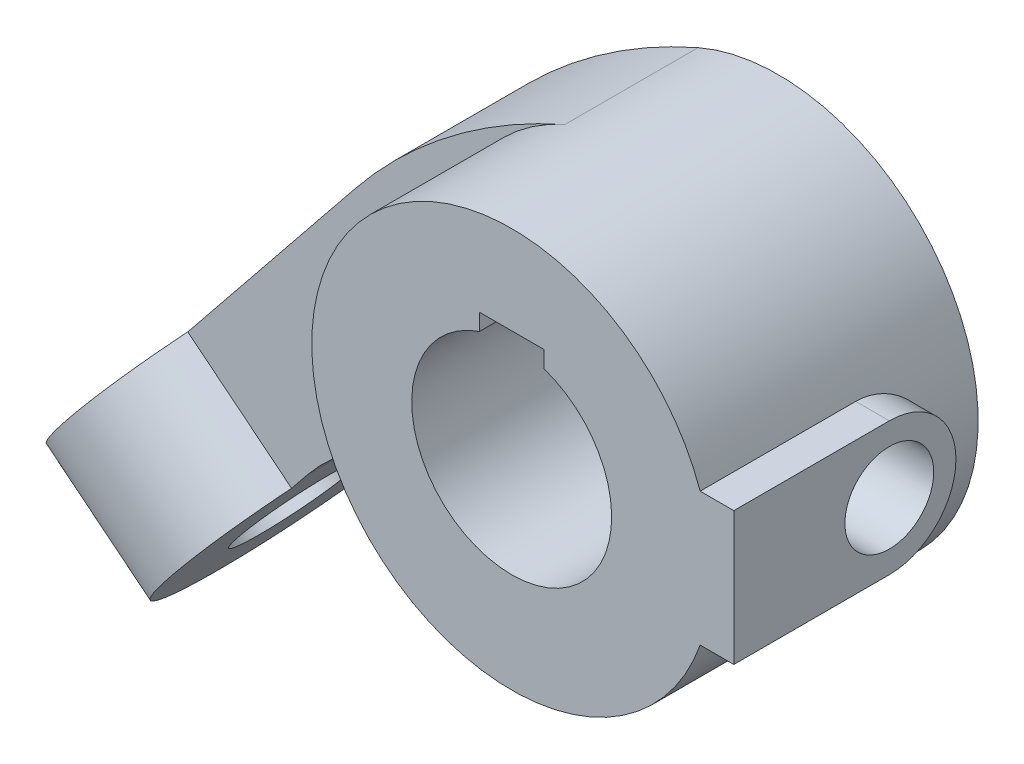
ISO-10303-21;
HEADER;
FILE_DESCRIPTION(('STEP AP214'),'2;1');
FILE_NAME('part.step','',(''),(''),'','','');
FILE_SCHEMA(('AUTOMOTIVE_DESIGN { 1 0 10303 214 1 1 1 1 }'));
ENDSEC;
DATA;
#1=APPLICATION_CONTEXT('core data for automotive mechanical design processes');
#2=APPLICATION_PROTOCOL_DEFINITION('international standard','automotive_design',2000,#1);
#3=PRODUCT_CONTEXT('',#1,'mechanical');
#4=PRODUCT('Part','Part','',(#3));
#5=PRODUCT_RELATED_PRODUCT_CATEGORY('part','',(#4));
#6=PRODUCT_DEFINITION_FORMATION('','',#4);
#7=PRODUCT_DEFINITION_CONTEXT('part definition',#1,'design');
#8=PRODUCT_DEFINITION('design','',#6,#7);
#9=PRODUCT_DEFINITION_SHAPE('','',#8);
#10=(LENGTH_UNIT() NAMED_UNIT(*) SI_UNIT(.MILLI.,.METRE.));
#11=(NAMED_UNIT(*) PLANE_ANGLE_UNIT() SI_UNIT($,.RADIAN.));
#12=(NAMED_UNIT(*) SI_UNIT($,.STERADIAN.) SOLID_ANGLE_UNIT());
#13=UNCERTAINTY_MEASURE_WITH_UNIT(LENGTH_MEASURE(1.E-05),#10,'distance_accuracy_value','');
#14=(GEOMETRIC_REPRESENTATION_CONTEXT(3) GLOBAL_UNCERTAINTY_ASSIGNED_CONTEXT((#13)) GLOBAL_UNIT_ASSIGNED_CONTEXT((#10,
#11,#12)) REPRESENTATION_CONTEXT('',''));
#15=CARTESIAN_POINT('',(0.,0.,0.));
#16=DIRECTION('',(0.,0.,1.));
#17=DIRECTION('',(1.,0.,0.));
#18=AXIS2_PLACEMENT_3D('',#15,#16,#17);
#19=CARTESIAN_POINT('',(0.,0.,24.));
#20=DIRECTION('',(0.,0.,1.));
#21=DIRECTION('',(1.,0.,0.));
#22=AXIS2_PLACEMENT_3D('',#19,#20,#21);
#23=PLANE('',#22);
#24=CARTESIAN_POINT('',(0.,0.,24.));
#25=DIRECTION('',(0.,0.,1.));
#26=DIRECTION('',(1.,0.,0.));
#27=AXIS2_PLACEMENT_3D('',#24,#25,#26);
#28=CIRCLE('',#27,18.);
#29=CARTESIAN_POINT('',(16.9705627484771,6.,24.));
#30=VERTEX_POINT('',#29);
#31=CARTESIAN_POINT('',(16.9705627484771,-6.,24.));
#32=VERTEX_POINT('',#31);
#33=EDGE_CURVE('E54',#30,#32,#28,.T.);
#34=ORIENTED_EDGE('',*,*,#33,.T.);
#35=DIRECTION('',(1.,0.,0.));
#36=VECTOR('',#35,1.);
#37=CARTESIAN_POINT('',(-500000.,-6.,24.));
#38=LINE('',#37,#36);
#39=CARTESIAN_POINT('',(20.,-6.,24.));
#40=VERTEX_POINT('',#39);
#41=EDGE_CURVE('E61',#32,#40,#38,.T.);
#42=ORIENTED_EDGE('',*,*,#41,.T.);
#43=DIRECTION('',(0.,-1.,0.));
#44=VECTOR('',#43,1.);
#45=CARTESIAN_POINT('',(20.,6.,24.));
#46=LINE('',#45,#44);
#47=CARTESIAN_POINT('',(20.,6.,24.));
#48=VERTEX_POINT('',#47);
#49=EDGE_CURVE('E164',#48,#40,#46,.T.);
#50=ORIENTED_EDGE('',*,*,#49,.F.);
#51=DIRECTION('',(1.,0.,0.));
#52=VECTOR('',#51,1.);
#53=CARTESIAN_POINT('',(-500000.,6.,24.));
#54=LINE('',#53,#52);
#55=EDGE_CURVE('E151',#30,#48,#54,.T.);
#56=ORIENTED_EDGE('',*,*,#55,.F.);
#57=EDGE_LOOP('',(#34,#42,#50,#56));
#58=FACE_BOUND('',#57,.T.);
#59=DIRECTION('',(0.,1.,0.));
#60=VECTOR('',#59,1.);
#61=CARTESIAN_POINT('',(2.90072703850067,10.0197290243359,24.));
#62=LINE('',#61,#60);
#63=CARTESIAN_POINT('',(2.90072703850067,8.51972902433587,24.));
#64=VERTEX_POINT('',#63);
#65=CARTESIAN_POINT('',(2.90072703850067,10.0197290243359,24.));
#66=VERTEX_POINT('',#65);
#67=EDGE_CURVE('E200',#64,#66,#62,.T.);
#68=ORIENTED_EDGE('',*,*,#67,.F.);
#69=CARTESIAN_POINT('',(0.,0.,24.));
#70=DIRECTION('',(0.,0.,1.));
#71=DIRECTION('',(1.,0.,0.));
#72=AXIS2_PLACEMENT_3D('',#69,#70,#71);
#73=CIRCLE('',#72,9.);
#74=CARTESIAN_POINT('',(-2.90072703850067,8.51972902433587,24.));
#75=VERTEX_POINT('',#74);
#76=EDGE_CURVE('E185',#75,#64,#73,.T.);
#77=ORIENTED_EDGE('',*,*,#76,.F.);
#78=DIRECTION('',(0.,-1.,0.));
#79=VECTOR('',#78,1.);
#80=CARTESIAN_POINT('',(-2.90072703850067,8.51972902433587,24.));
#81=LINE('',#80,#79);
#82=CARTESIAN_POINT('',(-2.90072703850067,10.0197290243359,24.));
#83=VERTEX_POINT('',#82);
#84=EDGE_CURVE('E181',#83,#75,#81,.T.);
#85=ORIENTED_EDGE('',*,*,#84,.F.);
#86=DIRECTION('',(-1.,0.,0.));
#87=VECTOR('',#86,1.);
#88=CARTESIAN_POINT('',(-2.90072703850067,10.0197290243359,24.));
#89=LINE('',#88,#87);
#90=EDGE_CURVE('E197',#66,#83,#89,.T.);
#91=ORIENTED_EDGE('',*,*,#90,.F.);
#92=EDGE_LOOP('',(#68,#77,#85,#91));
#93=FACE_BOUND('',#92,.T.);
#94=ADVANCED_FACE('F45',(#58,#93),#23,.T.);
#95=CARTESIAN_POINT('',(0.,0.,0.));
#96=DIRECTION('',(0.,0.,1.));
#97=DIRECTION('',(1.,0.,0.));
#98=AXIS2_PLACEMENT_3D('',#95,#96,#97);
#99=PLANE('',#98);
#100=DIRECTION('',(-0.627253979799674,-0.778814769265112,0.));
#101=VECTOR('',#100,1.);
#102=CARTESIAN_POINT('',(-37.7431371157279,-31.5320829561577,0.));
#103=LINE('',#102,#101);
#104=CARTESIAN_POINT('',(-30.4178085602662,-22.4367655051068,0.));
#105=VERTEX_POINT('',#104);
#106=CARTESIAN_POINT('',(-31.8145022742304,-24.1709365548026,0.));
#107=VERTEX_POINT('',#106);
#108=EDGE_CURVE('E212',#105,#107,#103,.T.);
#109=ORIENTED_EDGE('',*,*,#108,.T.);
#110=DIRECTION('',(0.778814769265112,-0.627253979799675,0.));
#111=VECTOR('',#110,1.);
#112=CARTESIAN_POINT('',(-41.1602795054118,-16.6438887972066,0.));
#113=LINE('',#112,#111);
#114=CARTESIAN_POINT('',(-41.1602795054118,-16.6438887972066,0.));
#115=VERTEX_POINT('',#114);
#116=EDGE_CURVE('E224',#107,#115,#113,.F.);
#117=ORIENTED_EDGE('',*,*,#116,.T.);
#118=DIRECTION('',(0.627253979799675,0.778814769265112,0.));
#119=VECTOR('',#118,1.);
#120=CARTESIAN_POINT('',(-41.4315114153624,-16.9806573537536,0.));
#121=LINE('',#120,#119);
#122=CARTESIAN_POINT('',(-26.1041262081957,2.05022066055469,0.));
#123=VERTEX_POINT('',#122);
#124=EDGE_CURVE('E222',#115,#123,#121,.T.);
#125=ORIENTED_EDGE('',*,*,#124,.T.);
#126=CARTESIAN_POINT('',(12.8366122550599,-29.312478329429,0.));
#127=DIRECTION('',(0.,0.,-1.));
#128=DIRECTION('',(-1.,0.,0.));
#129=AXIS2_PLACEMENT_3D('',#126,#127,#128);
#130=CIRCLE('',#129,50.);
#131=CARTESIAN_POINT('',(-7.22059439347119,16.4882690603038,0.));
#132=VERTEX_POINT('',#131);
#133=EDGE_CURVE('E219',#123,#132,#130,.T.);
#134=ORIENTED_EDGE('',*,*,#133,.T.);
#135=CARTESIAN_POINT('',(0.,0.,0.));
#136=DIRECTION('',(0.,0.,1.));
#137=DIRECTION('',(1.,0.,0.));
#138=AXIS2_PLACEMENT_3D('',#135,#136,#137);
#139=CIRCLE('',#138,18.);
#140=CARTESIAN_POINT('',(-7.0301904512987,-16.5703476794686,0.));
#141=VERTEX_POINT('',#140);
#142=EDGE_CURVE('E167',#141,#132,#139,.T.);
#143=ORIENTED_EDGE('',*,*,#142,.F.);
#144=CARTESIAN_POINT('',(-14.8415131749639,-34.9818451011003,0.));
#145=DIRECTION('',(0.,0.,1.));
#146=DIRECTION('',(-1.,0.,0.));
#147=AXIS2_PLACEMENT_3D('',#144,#145,#146);
#148=CIRCLE('',#147,20.);
#149=EDGE_CURVE('E216',#141,#105,#148,.T.);
#150=ORIENTED_EDGE('',*,*,#149,.T.);
#151=EDGE_LOOP('',(#109,#117,#125,#134,#143,#150));
#152=FACE_BOUND('',#151,.T.);
#153=CARTESIAN_POINT('',(0.,0.,0.));
#154=DIRECTION('',(0.,0.,1.));
#155=DIRECTION('',(1.,0.,0.));
#156=AXIS2_PLACEMENT_3D('',#153,#154,#155);
#157=CIRCLE('',#156,9.);
#158=CARTESIAN_POINT('',(-2.90072703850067,8.51972902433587,0.));
#159=VERTEX_POINT('',#158);
#160=CARTESIAN_POINT('',(2.90072703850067,8.51972902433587,0.));
#161=VERTEX_POINT('',#160);
#162=EDGE_CURVE('E192',#159,#161,#157,.T.);
#163=ORIENTED_EDGE('',*,*,#162,.T.);
#164=DIRECTION('',(0.,1.,0.));
#165=VECTOR('',#164,1.);
#166=CARTESIAN_POINT('',(2.90072703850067,10.0197290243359,0.));
#167=LINE('',#166,#165);
#168=CARTESIAN_POINT('',(2.90072703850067,10.0197290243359,0.));
#169=VERTEX_POINT('',#168);
#170=EDGE_CURVE('E189',#161,#169,#167,.T.);
#171=ORIENTED_EDGE('',*,*,#170,.T.);
#172=DIRECTION('',(-1.,0.,0.));
#173=VECTOR('',#172,1.);
#174=CARTESIAN_POINT('',(-2.90072703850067,10.0197290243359,0.));
#175=LINE('',#174,#173);
#176=CARTESIAN_POINT('',(-2.90072703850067,10.0197290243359,0.));
#177=VERTEX_POINT('',#176);
#178=EDGE_CURVE('E186',#169,#177,#175,.T.);
#179=ORIENTED_EDGE('',*,*,#178,.T.);
#180=DIRECTION('',(0.,-1.,0.));
#181=VECTOR('',#180,1.);
#182=CARTESIAN_POINT('',(-2.90072703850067,8.51972902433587,0.));
#183=LINE('',#182,#181);
#184=EDGE_CURVE('E182',#177,#159,#183,.T.);
#185=ORIENTED_EDGE('',*,*,#184,.T.);
#186=EDGE_LOOP('',(#163,#171,#179,#185));
#187=FACE_BOUND('',#186,.T.);
#188=ADVANCED_FACE('F290',(#152,#187),#99,.F.);
#189=CARTESIAN_POINT('',(0.,0.,24.));
#190=DIRECTION('',(0.,0.,-1.));
#191=DIRECTION('',(-1.,0.,0.));
#192=AXIS2_PLACEMENT_3D('',#189,#190,#191);
#193=CYLINDRICAL_SURFACE('',#192,18.);
#194=CARTESIAN_POINT('',(0.,0.,12.));
#195=DIRECTION('',(0.,0.,1.));
#196=DIRECTION('',(-1.,0.,0.));
#197=AXIS2_PLACEMENT_3D('',#194,#195,#196);
#198=CIRCLE('',#197,18.);
#199=CARTESIAN_POINT('',(-7.22059439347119,16.4882690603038,12.));
#200=VERTEX_POINT('',#199);
#201=CARTESIAN_POINT('',(-7.0301904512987,-16.5703476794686,12.));
#202=VERTEX_POINT('',#201);
#203=EDGE_CURVE('E230',#200,#202,#198,.T.);
#204=ORIENTED_EDGE('',*,*,#203,.T.);
#205=DIRECTION('',(0.,0.,-1.));
#206=VECTOR('',#205,1.);
#207=CARTESIAN_POINT('',(-7.0301904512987,-16.5703476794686,12.));
#208=LINE('',#207,#206);
#209=EDGE_CURVE('E208',#202,#141,#208,.T.);
#210=ORIENTED_EDGE('',*,*,#209,.T.);
#211=ORIENTED_EDGE('',*,*,#142,.T.);
#212=DIRECTION('',(0.,0.,-1.));
#213=VECTOR('',#212,1.);
#214=CARTESIAN_POINT('',(-7.22059439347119,16.4882690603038,12.));
#215=LINE('',#214,#213);
#216=EDGE_CURVE('E69',#200,#132,#215,.T.);
#217=ORIENTED_EDGE('',*,*,#216,.F.);
#218=EDGE_LOOP('',(#204,#210,#211,#217));
#219=FACE_BOUND('',#218,.T.);
#220=ORIENTED_EDGE('',*,*,#33,.F.);
#221=DIRECTION('',(0.,0.,-1.));
#222=VECTOR('',#221,1.);
#223=CARTESIAN_POINT('',(16.9705627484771,6.,24.));
#224=LINE('',#223,#222);
#225=CARTESIAN_POINT('',(16.9705627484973,6.,10.));
#226=VERTEX_POINT('',#225);
#227=EDGE_CURVE('E147',#226,#30,#224,.F.);
#228=ORIENTED_EDGE('',*,*,#227,.F.);
#229=CARTESIAN_POINT('',(16.9705627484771,-6.,10.));
#230=CARTESIAN_POINT('',(16.9705358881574,-6.00002327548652,9.83630598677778));
#231=CARTESIAN_POINT('',(16.9729302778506,-5.99330214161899,9.6726221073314));
#232=CARTESIAN_POINT('',(16.9823649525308,-5.96654425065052,9.34652402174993));
#233=CARTESIAN_POINT('',(16.9894039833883,-5.94651108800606,9.18410948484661));
#234=CARTESIAN_POINT('',(17.0079041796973,-5.89338071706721,8.86218579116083));
#235=CARTESIAN_POINT('',(17.0193522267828,-5.86032225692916,8.70266947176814));
#236=CARTESIAN_POINT('',(17.0463054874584,-5.78145443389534,8.38716979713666));
#237=CARTESIAN_POINT('',(17.0618108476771,-5.73564461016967,8.23118656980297));
#238=CARTESIAN_POINT('',(17.096396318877,-5.63171582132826,7.92393152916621));
#239=CARTESIAN_POINT('',(17.1154735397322,-5.57360680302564,7.77265602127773));
#240=CARTESIAN_POINT('',(17.1566605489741,-5.44550500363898,7.47558904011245));
#241=CARTESIAN_POINT('',(17.1787714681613,-5.37550778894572,7.32979963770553));
#242=CARTESIAN_POINT('',(17.2254031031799,-5.22415126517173,7.04461346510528));
#243=CARTESIAN_POINT('',(17.2499242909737,-5.14278972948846,6.90521795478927));
#244=CARTESIAN_POINT('',(17.3007173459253,-4.96924085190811,6.63360277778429));
#245=CARTESIAN_POINT('',(17.326989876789,-4.8770493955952,6.50138586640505));
#246=CARTESIAN_POINT('',(17.3815260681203,-4.67904463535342,6.24043953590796));
#247=CARTESIAN_POINT('',(17.4098272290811,-4.57286774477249,6.11199371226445));
#248=CARTESIAN_POINT('',(17.4667935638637,-4.35021031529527,5.86437382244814));
#249=CARTESIAN_POINT('',(17.49545886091,-4.23372620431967,5.74520299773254));
#250=CARTESIAN_POINT('',(17.5523750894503,-3.99119540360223,5.51691026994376));
#251=CARTESIAN_POINT('',(17.5806260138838,-3.86514855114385,5.40778853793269));
#252=CARTESIAN_POINT('',(17.6359611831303,-3.60425478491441,5.20029931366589));
#253=CARTESIAN_POINT('',(17.6630454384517,-3.46940795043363,5.1019317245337));
#254=CARTESIAN_POINT('',(17.716017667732,-3.18806208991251,4.91417565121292));
#255=CARTESIAN_POINT('',(17.7418552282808,-3.04134950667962,4.82509253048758));
#256=CARTESIAN_POINT('',(17.790803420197,-2.74053335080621,4.65968846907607));
#257=CARTESIAN_POINT('',(17.8139150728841,-2.5864325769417,4.58336274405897));
#258=CARTESIAN_POINT('',(17.8567641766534,-2.27182245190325,4.44406426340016));
#259=CARTESIAN_POINT('',(17.8765010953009,-2.1113120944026,4.38109361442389));
#260=CARTESIAN_POINT('',(17.9120119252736,-1.78513959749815,4.26911941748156));
#261=CARTESIAN_POINT('',(17.9277876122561,-1.61947980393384,4.22010961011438));
#262=CARTESIAN_POINT('',(17.9544516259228,-1.28997729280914,4.13793631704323));
#263=CARTESIAN_POINT('',(17.9654893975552,-1.12626807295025,4.10428575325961));
#264=CARTESIAN_POINT('',(17.9831292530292,-0.796442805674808,4.05074979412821));
#265=CARTESIAN_POINT('',(17.9897331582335,-0.630327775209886,4.03085874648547));
#266=CARTESIAN_POINT('',(17.9983239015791,-0.296898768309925,4.00501776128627));
#267=CARTESIAN_POINT('',(18.0003107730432,-0.129584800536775,3.99906772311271));
#268=CARTESIAN_POINT('',(17.999610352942,0.204943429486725,4.00116890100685));
#269=CARTESIAN_POINT('',(17.9969231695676,0.372157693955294,4.00921979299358));
#270=CARTESIAN_POINT('',(17.987149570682,0.698613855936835,4.03864685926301));
#271=CARTESIAN_POINT('',(17.9802409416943,0.857909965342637,4.05948465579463));
#272=CARTESIAN_POINT('',(17.9623622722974,1.17415159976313,4.1138198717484));
#273=CARTESIAN_POINT('',(17.9513908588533,1.33109631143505,4.14732157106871));
#274=CARTESIAN_POINT('',(17.9256761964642,1.64145470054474,4.22667565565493));
#275=CARTESIAN_POINT('',(17.9109342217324,1.79486955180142,4.27252386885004));
#276=CARTESIAN_POINT('',(17.8780472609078,2.09727695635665,4.37621207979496));
#277=CARTESIAN_POINT('',(17.8599009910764,2.24626781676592,4.4340566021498));
#278=CARTESIAN_POINT('',(17.8204139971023,2.54070679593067,4.56208597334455));
#279=CARTESIAN_POINT('',(17.7990354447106,2.686085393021,4.632418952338));
#280=CARTESIAN_POINT('',(17.753792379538,2.97045362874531,4.78440731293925));
#281=CARTESIAN_POINT('',(17.7299270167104,3.10944105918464,4.86606656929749));
#282=CARTESIAN_POINT('',(17.6803107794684,3.38017058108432,5.04012638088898));
#283=CARTESIAN_POINT('',(17.6545598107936,3.51191230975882,5.13252747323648));
#284=CARTESIAN_POINT('',(17.601809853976,3.76740071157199,5.32747242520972));
#285=CARTESIAN_POINT('',(17.5748108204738,3.89114709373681,5.43001665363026));
#286=CARTESIAN_POINT('',(17.5189422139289,4.13559143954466,5.64969602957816));
#287=CARTESIAN_POINT('',(17.4900445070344,4.2558696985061,5.76729146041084));
#288=CARTESIAN_POINT('',(17.4324086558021,4.48611320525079,6.01214074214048));
#289=CARTESIAN_POINT('',(17.4036704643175,4.59608167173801,6.13939155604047));
#290=CARTESIAN_POINT('',(17.3471202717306,4.8051173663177,6.40289722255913));
#291=CARTESIAN_POINT('',(17.3193089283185,4.90417696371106,6.53915827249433));
#292=CARTESIAN_POINT('',(17.2654357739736,5.09059336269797,6.81971485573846));
#293=CARTESIAN_POINT('',(17.239373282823,5.17795472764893,6.96400722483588));
#294=CARTESIAN_POINT('',(17.1893738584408,5.34161618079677,7.2620310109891));
#295=CARTESIAN_POINT('',(17.1654753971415,5.41772728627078,7.41587280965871));
#296=CARTESIAN_POINT('',(17.1210224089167,5.556609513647,7.72985774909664));
#297=CARTESIAN_POINT('',(17.1004664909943,5.61938618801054,7.8899982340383));
#298=CARTESIAN_POINT('',(17.0633817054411,5.73100924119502,8.21532287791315));
#299=CARTESIAN_POINT('',(17.0468484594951,5.7798707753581,8.38050133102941));
#300=CARTESIAN_POINT('',(17.0183470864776,5.86325820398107,8.71475296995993));
#301=CARTESIAN_POINT('',(17.0063768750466,5.89779064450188,8.88382434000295));
#302=CARTESIAN_POINT('',(16.9882040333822,5.94992929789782,9.21046348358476));
#303=CARTESIAN_POINT('',(16.9816058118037,5.96870055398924,9.36782418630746));
#304=CARTESIAN_POINT('',(16.9727764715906,5.99373749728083,9.6834525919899));
#305=CARTESIAN_POINT('',(16.9705397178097,6.00001932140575,9.84171885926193));
#306=CARTESIAN_POINT('',(16.9705627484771,6.,10.));
#307=B_SPLINE_CURVE_WITH_KNOTS('',3,(#229,#230,#231,#232,#233,#234,#235,#236,#237,#238,#239,
#240,#241,#242,#243,#244,#245,#246,#247,#248,#249,#250,#251,#252,#253,#254,#255,#256,#257,#258,
#259,#260,#261,#262,#263,#264,#265,#266,#267,#268,#269,#270,#271,#272,#273,#274,#275,#276,#277,
#278,#279,#280,#281,#282,#283,#284,#285,#286,#287,#288,#289,#290,#291,#292,#293,#294,#295,#296,
#297,#298,#299,#300,#301,#302,#303,#304,#305,#306),.UNSPECIFIED.,.F.,.F.,(4,2,2,2,2,2,2,2,2,2,2,
2,2,2,2,2,2,2,2,2,2,2,2,2,2,2,2,2,2,2,2,2,2,2,2,2,2,2,4),(0.,0.49091090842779,0.981689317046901,
1.47101863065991,1.96036563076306,2.4493183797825,2.93845388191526,3.427685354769,
3.91710329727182,4.42363425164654,4.93034144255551,5.43705725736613,5.94376850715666,
6.46384823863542,6.98373248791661,7.50369868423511,8.02343138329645,8.52528690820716,
9.0269361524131,9.52858177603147,10.0302157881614,10.5120543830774,10.9940559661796,
11.4758948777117,11.9579158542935,12.4460912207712,12.9344340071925,13.4228012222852,
13.9111862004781,14.4226273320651,14.9339082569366,15.445544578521,15.9569807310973,
16.4762155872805,16.9952338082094,17.5136845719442,18.0318982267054,18.5071898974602,
18.9818670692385),.UNSPECIFIED.);
#308=CARTESIAN_POINT('',(16.9705627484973,-6.,10.));
#309=VERTEX_POINT('',#308);
#310=EDGE_CURVE('E158',#309,#226,#307,.T.);
#311=ORIENTED_EDGE('',*,*,#310,.F.);
#312=DIRECTION('',(0.,0.,-1.));
#313=VECTOR('',#312,1.);
#314=CARTESIAN_POINT('',(16.9705627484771,-6.,24.));
#315=LINE('',#314,#313);
#316=EDGE_CURVE('E157',#32,#309,#315,.T.);
#317=ORIENTED_EDGE('',*,*,#316,.F.);
#318=EDGE_LOOP('',(#220,#228,#311,#317));
#319=FACE_BOUND('',#318,.T.);
#320=ADVANCED_FACE('F47',(#219,#319),#193,.T.);
#321=CARTESIAN_POINT('',(0.,0.,24.));
#322=DIRECTION('',(0.,0.,-1.));
#323=DIRECTION('',(-1.,0.,0.));
#324=AXIS2_PLACEMENT_3D('',#321,#322,#323);
#325=CYLINDRICAL_SURFACE('',#324,9.);
#326=CARTESIAN_POINT('',(9.,0.,6.));
#327=CARTESIAN_POINT('',(8.99999931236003,0.106543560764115,6.00000083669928));
#328=CARTESIAN_POINT('',(8.99810295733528,0.21311453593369,6.00426262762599));
#329=CARTESIAN_POINT('',(8.99056534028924,0.425487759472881,6.02126641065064));
#330=CARTESIAN_POINT('',(8.9849219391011,0.531289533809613,6.03401324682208));
#331=CARTESIAN_POINT('',(8.97002203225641,0.741497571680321,6.06788489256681));
#332=CARTESIAN_POINT('',(8.96075877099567,0.845900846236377,6.08902536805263));
#333=CARTESIAN_POINT('',(8.93886560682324,1.0523739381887,6.13945271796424));
#334=CARTESIAN_POINT('',(8.92623432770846,1.15444278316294,6.16874292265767));
#335=CARTESIAN_POINT('',(8.88385509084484,1.45528706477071,6.26817316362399));
#336=CARTESIAN_POINT('',(8.84954694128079,1.64969223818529,6.35003546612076));
#337=CARTESIAN_POINT('',(8.77205693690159,2.02169397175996,6.54215732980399));
#338=CARTESIAN_POINT('',(8.72887710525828,2.19929435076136,6.65241041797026));
#339=CARTESIAN_POINT('',(8.63520005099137,2.54295194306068,6.90467040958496));
#340=CARTESIAN_POINT('',(8.58444255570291,2.70796463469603,7.048005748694));
#341=CARTESIAN_POINT('',(8.48237167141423,3.01251193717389,7.35948605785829));
#342=CARTESIAN_POINT('',(8.43105797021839,3.15203136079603,7.52764570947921));
#343=CARTESIAN_POINT('',(8.33031613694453,3.40970641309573,7.89592097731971));
#344=CARTESIAN_POINT('',(8.28116793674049,3.52616342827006,8.09732107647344));
#345=CARTESIAN_POINT('',(8.21620901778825,3.67379855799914,8.41355835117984));
#346=CARTESIAN_POINT('',(8.19601074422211,3.71851343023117,8.52136957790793));
#347=CARTESIAN_POINT('',(8.15924882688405,3.79849956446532,8.74101911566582));
#348=CARTESIAN_POINT('',(8.14268322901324,3.83377590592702,8.85285522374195));
#349=CARTESIAN_POINT('',(8.11458487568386,3.89288163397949,9.0737900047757));
#350=CARTESIAN_POINT('',(8.1028347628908,3.91721191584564,9.18272742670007));
#351=CARTESIAN_POINT('',(8.08362129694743,3.95670961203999,9.40257833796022));
#352=CARTESIAN_POINT('',(8.07615587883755,3.9718814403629,9.51349084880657));
#353=CARTESIAN_POINT('',(8.06579894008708,3.99287182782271,9.73637224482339));
#354=CARTESIAN_POINT('',(8.06290582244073,3.99869365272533,9.84834074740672));
#355=CARTESIAN_POINT('',(8.06180452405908,4.00091360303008,10.0723891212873));
#356=CARTESIAN_POINT('',(8.06359604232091,3.99731233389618,10.1844689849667));
#357=CARTESIAN_POINT('',(8.07142338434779,3.98148137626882,10.3977271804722));
#358=CARTESIAN_POINT('',(8.07706352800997,3.97005575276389,10.4989804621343));
#359=CARTESIAN_POINT('',(8.09197245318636,3.9395760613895,10.7000710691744));
#360=CARTESIAN_POINT('',(8.10124240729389,3.92051952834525,10.7999079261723));
#361=CARTESIAN_POINT('',(8.13408651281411,3.85217674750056,11.0962376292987));
#362=CARTESIAN_POINT('',(8.16270181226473,3.79170447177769,11.2897178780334));
#363=CARTESIAN_POINT('',(8.23081734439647,3.64150006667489,11.6678984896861));
#364=CARTESIAN_POINT('',(8.2705474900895,3.5511416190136,11.8523042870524));
#365=CARTESIAN_POINT('',(8.35638151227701,3.34416344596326,12.2041434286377));
#366=CARTESIAN_POINT('',(8.40248806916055,3.22753266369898,12.3715695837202));
#367=CARTESIAN_POINT('',(8.50133279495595,2.95801583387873,12.701829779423));
#368=CARTESIAN_POINT('',(8.55427944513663,2.80270476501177,12.8626276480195));
#369=CARTESIAN_POINT('',(8.65709798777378,2.46687651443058,13.1566341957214));
#370=CARTESIAN_POINT('',(8.70696894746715,2.28635173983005,13.2898345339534));
#371=CARTESIAN_POINT('',(8.79984898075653,1.89830549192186,13.5284266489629));
#372=CARTESIAN_POINT('',(8.84261183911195,1.69014406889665,13.6328807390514));
#373=CARTESIAN_POINT('',(8.91451161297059,1.25681485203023,13.8045538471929));
#374=CARTESIAN_POINT('',(8.94365711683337,1.03165788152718,13.8717963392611));
#375=CARTESIAN_POINT('',(8.98336516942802,0.587641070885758,13.9626237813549));
#376=CARTESIAN_POINT('',(8.99508492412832,0.369442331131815,13.9889334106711));
#377=CARTESIAN_POINT('',(9.00240007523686,-0.0685540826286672,14.005406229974));
#378=CARTESIAN_POINT('',(8.9980009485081,-0.288351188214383,13.9955816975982));
#379=CARTESIAN_POINT('',(8.97430591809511,-0.70981481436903,13.9419129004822));
#380=CARTESIAN_POINT('',(8.95589038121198,-0.911792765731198,13.9000783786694));
#381=CARTESIAN_POINT('',(8.90701082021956,-1.30558421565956,13.7864838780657));
#382=CARTESIAN_POINT('',(8.87654533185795,-1.49739647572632,13.7147202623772));
#383=CARTESIAN_POINT('',(8.80524764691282,-1.87220783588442,13.5410228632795));
#384=CARTESIAN_POINT('',(8.76412168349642,-2.05474529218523,13.4382176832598));
#385=CARTESIAN_POINT('',(8.67576208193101,-2.40063957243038,13.2062947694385));
#386=CARTESIAN_POINT('',(8.62852578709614,-2.56398799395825,13.0771655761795));
#387=CARTESIAN_POINT('',(8.52825739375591,-2.88073032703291,12.7841760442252));
#388=CARTESIAN_POINT('',(8.4750650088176,-3.03226090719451,12.6183553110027));
#389=CARTESIAN_POINT('',(8.37207677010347,-3.30602071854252,12.2628521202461));
#390=CARTESIAN_POINT('',(8.32228212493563,-3.42823956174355,12.0731612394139));
#391=CARTESIAN_POINT('',(8.25404075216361,-3.5880743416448,11.771754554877));
#392=CARTESIAN_POINT('',(8.23214803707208,-3.63788387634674,11.6671202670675));
#393=CARTESIAN_POINT('',(8.19154569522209,-3.72840991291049,11.4534110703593));
#394=CARTESIAN_POINT('',(8.17283464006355,-3.76913049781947,11.3443381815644));
#395=CARTESIAN_POINT('',(8.13929816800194,-3.84101557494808,11.1225782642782));
#396=CARTESIAN_POINT('',(8.1244705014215,-3.87218560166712,11.0098933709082));
#397=CARTESIAN_POINT('',(8.09927719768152,-3.92460929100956,10.7817509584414));
#398=CARTESIAN_POINT('',(8.08891105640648,-3.94586407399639,10.6662937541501));
#399=CARTESIAN_POINT('',(8.07374935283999,-3.9767877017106,10.4435206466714));
#400=CARTESIAN_POINT('',(8.06855529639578,-3.98728755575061,10.3363465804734));
#401=CARTESIAN_POINT('',(8.06245450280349,-3.99960939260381,10.1213401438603));
#402=CARTESIAN_POINT('',(8.06154919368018,-4.0014284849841,10.0135075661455));
#403=CARTESIAN_POINT('',(8.06406616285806,-3.99635429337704,9.79815592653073));
#404=CARTESIAN_POINT('',(8.06748593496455,-3.98946605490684,9.69063671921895));
#405=CARTESIAN_POINT('',(8.07851431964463,-3.96708318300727,9.47670234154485));
#406=CARTESIAN_POINT('',(8.08612450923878,-3.95158530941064,9.37028760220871));
#407=CARTESIAN_POINT('',(8.11370655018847,-3.89481025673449,9.06674665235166));
#408=CARTESIAN_POINT('',(8.13866591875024,-3.84284512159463,8.87195606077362));
#409=CARTESIAN_POINT('',(8.19957700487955,-3.71108221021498,8.49400105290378));
#410=CARTESIAN_POINT('',(8.23553189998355,-3.63127638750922,8.31084001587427));
#411=CARTESIAN_POINT('',(8.31722161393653,-3.44024324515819,7.94833529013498));
#412=CARTESIAN_POINT('',(8.36343549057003,-3.32733013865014,7.76998832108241));
#413=CARTESIAN_POINT('',(8.45929191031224,-3.0754694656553,7.43374675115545));
#414=CARTESIAN_POINT('',(8.50893588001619,-2.93651102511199,7.27586073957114));
#415=CARTESIAN_POINT('',(8.61126362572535,-2.622172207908,6.97075949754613));
#416=CARTESIAN_POINT('',(8.66383343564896,-2.44466910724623,6.82568584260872));
#417=CARTESIAN_POINT('',(8.76186799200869,-2.06586629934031,6.56711579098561));
#418=CARTESIAN_POINT('',(8.80732948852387,-1.86455578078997,6.45363381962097));
#419=CARTESIAN_POINT('',(8.86614466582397,-1.55009155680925,6.31078045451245));
#420=CARTESIAN_POINT('',(8.88411858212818,-1.44376115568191,6.267874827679));
#421=CARTESIAN_POINT('',(8.91658812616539,-1.22735110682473,6.19122606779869));
#422=CARTESIAN_POINT('',(8.93108542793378,-1.11727329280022,6.15747852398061));
#423=CARTESIAN_POINT('',(8.95614098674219,-0.894475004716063,6.09959768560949));
#424=CARTESIAN_POINT('',(8.96670865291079,-0.781761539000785,6.07544141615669));
#425=CARTESIAN_POINT('',(8.9836293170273,-0.554414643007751,6.03693326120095));
#426=CARTESIAN_POINT('',(8.98998524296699,-0.439782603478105,6.02257456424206));
#427=CARTESIAN_POINT('',(8.99608997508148,-0.270722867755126,6.00880385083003));
#428=CARTESIAN_POINT('',(8.99755504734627,-0.216644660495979,6.005503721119));
#429=CARTESIAN_POINT('',(8.99951024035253,-0.108380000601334,6.00110157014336));
#430=CARTESIAN_POINT('',(9.00000034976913,-0.0541935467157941,5.99999957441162));
#431=CARTESIAN_POINT('',(9.,0.,6.));
#432=B_SPLINE_CURVE_WITH_KNOTS('',3,(#326,#327,#328,#329,#330,#331,#332,#333,#334,#335,#336,
#337,#338,#339,#340,#341,#342,#343,#344,#345,#346,#347,#348,#349,#350,#351,#352,#353,#354,#355,
#356,#357,#358,#359,#360,#361,#362,#363,#364,#365,#366,#367,#368,#369,#370,#371,#372,#373,#374,
#375,#376,#377,#378,#379,#380,#381,#382,#383,#384,#385,#386,#387,#388,#389,#390,#391,#392,#393,
#394,#395,#396,#397,#398,#399,#400,#401,#402,#403,#404,#405,#406,#407,#408,#409,#410,#411,#412,
#413,#414,#415,#416,#417,#418,#419,#420,#421,#422,#423,#424,#425,#426,#427,#428,#429,#430,#431),
.UNSPECIFIED.,.T.,.F.,(4,2,2,2,2,2,2,2,2,2,2,2,2,2,2,2,2,2,2,2,2,2,2,2,2,2,2,2,2,2,2,2,2,2,2,2,
2,2,2,2,2,2,2,2,2,2,2,2,2,2,2,2,4),(0.,0.319575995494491,0.639334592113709,0.959692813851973,
1.28018213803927,1.91817504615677,2.55602262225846,3.22626867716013,3.89691272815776,
4.6062783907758,4.96122462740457,5.31597945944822,5.65223953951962,5.9883374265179,
6.32431789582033,6.66027677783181,6.96605959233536,7.27194127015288,7.88320420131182,
8.50818797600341,9.1334352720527,9.81959120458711,10.5059542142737,11.2125921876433,
11.9187838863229,12.5755805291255,13.2321540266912,13.8505799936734,14.4690811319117,
15.1068781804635,15.7449534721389,16.4344546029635,17.1241997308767,17.4776093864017,
17.8308599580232,18.1839054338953,18.5369110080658,18.8599212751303,19.183039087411,
19.5059697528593,19.8290220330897,20.4355356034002,21.042224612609,21.6877902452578,
22.3336260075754,23.0359566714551,23.7386075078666,24.0863996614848,24.4340240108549,
24.7808105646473,25.1273557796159,25.2899067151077,25.4524595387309),.UNSPECIFIED.);
#433=CARTESIAN_POINT('',(9.,0.,6.));
#434=VERTEX_POINT('',#433);
#435=EDGE_CURVE('E268',#434,#434,#432,.T.);
#436=ORIENTED_EDGE('',*,*,#435,.T.);
#437=EDGE_LOOP('',(#436));
#438=FACE_BOUND('',#437,.T.);
#439=ORIENTED_EDGE('',*,*,#162,.F.);
#440=DIRECTION('',(0.,0.,-1.));
#441=VECTOR('',#440,1.);
#442=CARTESIAN_POINT('',(-2.90072703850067,8.51972902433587,24.));
#443=LINE('',#442,#441);
#444=EDGE_CURVE('E178',#75,#159,#443,.T.);
#445=ORIENTED_EDGE('',*,*,#444,.F.);
#446=ORIENTED_EDGE('',*,*,#76,.T.);
#447=DIRECTION('',(0.,0.,-1.));
#448=VECTOR('',#447,1.);
#449=CARTESIAN_POINT('',(2.90072703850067,8.51972902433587,24.));
#450=LINE('',#449,#448);
#451=EDGE_CURVE('E169',#64,#161,#450,.T.);
#452=ORIENTED_EDGE('',*,*,#451,.T.);
#453=EDGE_LOOP('',(#439,#445,#446,#452));
#454=FACE_BOUND('',#453,.T.);
#455=ADVANCED_FACE('F297',(#438,#454),#325,.F.);
#456=CARTESIAN_POINT('',(2.90072703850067,10.0197290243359,24.));
#457=DIRECTION('',(-1.,0.,0.));
#458=DIRECTION('',(0.,0.,1.));
#459=AXIS2_PLACEMENT_3D('',#456,#457,#458);
#460=PLANE('',#459);
#461=ORIENTED_EDGE('',*,*,#170,.F.);
#462=ORIENTED_EDGE('',*,*,#451,.F.);
#463=ORIENTED_EDGE('',*,*,#67,.T.);
#464=DIRECTION('',(0.,0.,-1.));
#465=VECTOR('',#464,1.);
#466=CARTESIAN_POINT('',(2.90072703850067,10.0197290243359,24.));
#467=LINE('',#466,#465);
#468=EDGE_CURVE('E174',#66,#169,#467,.T.);
#469=ORIENTED_EDGE('',*,*,#468,.T.);
#470=EDGE_LOOP('',(#461,#462,#463,#469));
#471=FACE_BOUND('',#470,.T.);
#472=ADVANCED_FACE('F300',(#471),#460,.T.);
#473=CARTESIAN_POINT('',(-2.90072703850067,10.0197290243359,24.));
#474=DIRECTION('',(0.,-1.,0.));
#475=DIRECTION('',(0.,0.,-1.));
#476=AXIS2_PLACEMENT_3D('',#473,#474,#475);
#477=PLANE('',#476);
#478=ORIENTED_EDGE('',*,*,#178,.F.);
#479=ORIENTED_EDGE('',*,*,#468,.F.);
#480=ORIENTED_EDGE('',*,*,#90,.T.);
#481=DIRECTION('',(0.,0.,-1.));
#482=VECTOR('',#481,1.);
#483=CARTESIAN_POINT('',(-2.90072703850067,10.0197290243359,24.));
#484=LINE('',#483,#482);
#485=EDGE_CURVE('E176',#83,#177,#484,.T.);
#486=ORIENTED_EDGE('',*,*,#485,.T.);
#487=EDGE_LOOP('',(#478,#479,#480,#486));
#488=FACE_BOUND('',#487,.T.);
#489=ADVANCED_FACE('F304',(#488),#477,.T.);
#490=CARTESIAN_POINT('',(-2.90072703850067,8.51972902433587,24.));
#491=DIRECTION('',(1.,0.,0.));
#492=DIRECTION('',(0.,0.,-1.));
#493=AXIS2_PLACEMENT_3D('',#490,#491,#492);
#494=PLANE('',#493);
#495=ORIENTED_EDGE('',*,*,#184,.F.);
#496=ORIENTED_EDGE('',*,*,#485,.F.);
#497=ORIENTED_EDGE('',*,*,#84,.T.);
#498=ORIENTED_EDGE('',*,*,#444,.T.);
#499=EDGE_LOOP('',(#495,#496,#497,#498));
#500=FACE_BOUND('',#499,.T.);
#501=ADVANCED_FACE('F308',(#500),#494,.T.);
#502=CARTESIAN_POINT('',(-37.7431371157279,-31.5320829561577,12.));
#503=DIRECTION('',(0.778814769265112,-0.627253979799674,0.));
#504=DIRECTION('',(0.627253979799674,0.778814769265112,0.));
#505=AXIS2_PLACEMENT_3D('',#502,#503,#504);
#506=PLANE('',#505);
#507=CARTESIAN_POINT('',(-37.5974982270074,-31.3512539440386,6.));
#508=DIRECTION('',(0.778814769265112,-0.627253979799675,0.));
#509=DIRECTION('',(0.627253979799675,0.778814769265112,0.));
#510=AXIS2_PLACEMENT_3D('',#507,#508,#509);
#511=CIRCLE('',#510,5.);
#512=CARTESIAN_POINT('',(-34.461228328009,-27.4571800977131,6.));
#513=VERTEX_POINT('',#512);
#514=EDGE_CURVE('E243',#513,#513,#511,.T.);
#515=ORIENTED_EDGE('',*,*,#514,.F.);
#516=EDGE_LOOP('',(#515));
#517=FACE_BOUND('',#516,.T.);
#518=CARTESIAN_POINT('',(-37.5974982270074,-31.3512539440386,6.));
#519=DIRECTION('',(0.778814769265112,-0.627253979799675,0.));
#520=DIRECTION('',(0.627253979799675,0.778814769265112,0.));
#521=AXIS2_PLACEMENT_3D('',#518,#519,#520);
#522=CIRCLE('',#521,11.);
#523=CARTESIAN_POINT('',(-31.8145022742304,-24.1709365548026,12.));
#524=VERTEX_POINT('',#523);
#525=EDGE_CURVE('E239',#524,#107,#522,.T.);
#526=ORIENTED_EDGE('',*,*,#525,.T.);
#527=ORIENTED_EDGE('',*,*,#108,.F.);
#528=DIRECTION('',(0.,0.,-1.));
#529=VECTOR('',#528,1.);
#530=CARTESIAN_POINT('',(-30.4178085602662,-22.4367655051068,12.));
#531=LINE('',#530,#529);
#532=CARTESIAN_POINT('',(-30.4178085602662,-22.4367655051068,12.));
#533=VERTEX_POINT('',#532);
#534=EDGE_CURVE('E195',#533,#105,#531,.T.);
#535=ORIENTED_EDGE('',*,*,#534,.F.);
#536=DIRECTION('',(-0.627253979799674,-0.778814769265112,0.));
#537=VECTOR('',#536,1.);
#538=CARTESIAN_POINT('',(-37.7431371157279,-31.5320829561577,12.));
#539=LINE('',#538,#537);
#540=EDGE_CURVE('E206',#533,#524,#539,.T.);
#541=ORIENTED_EDGE('',*,*,#540,.T.);
#542=EDGE_LOOP('',(#526,#527,#535,#541));
#543=FACE_BOUND('',#542,.T.);
#544=ADVANCED_FACE('F312',(#517,#543),#506,.T.);
#545=CARTESIAN_POINT('',(-14.8415131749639,-34.9818451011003,12.));
#546=DIRECTION('',(0.,0.,-1.));
#547=DIRECTION('',(-1.,0.,0.));
#548=AXIS2_PLACEMENT_3D('',#545,#546,#547);
#549=CYLINDRICAL_SURFACE('',#548,20.);
#550=ORIENTED_EDGE('',*,*,#149,.F.);
#551=ORIENTED_EDGE('',*,*,#209,.F.);
#552=CARTESIAN_POINT('',(-14.8415131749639,-34.9818451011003,12.));
#553=DIRECTION('',(0.,0.,1.));
#554=DIRECTION('',(-1.,0.,0.));
#555=AXIS2_PLACEMENT_3D('',#552,#553,#554);
#556=CIRCLE('',#555,20.);
#557=EDGE_CURVE('E227',#202,#533,#556,.T.);
#558=ORIENTED_EDGE('',*,*,#557,.T.);
#559=ORIENTED_EDGE('',*,*,#534,.T.);
#560=EDGE_LOOP('',(#550,#551,#558,#559));
#561=FACE_BOUND('',#560,.T.);
#562=ADVANCED_FACE('F322',(#561),#549,.F.);
#563=CARTESIAN_POINT('',(12.8366122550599,-29.312478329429,12.));
#564=DIRECTION('',(0.,0.,-1.));
#565=DIRECTION('',(-1.,0.,0.));
#566=AXIS2_PLACEMENT_3D('',#563,#564,#565);
#567=CYLINDRICAL_SURFACE('',#566,50.);
#568=ORIENTED_EDGE('',*,*,#133,.F.);
#569=DIRECTION('',(0.,0.,-1.));
#570=VECTOR('',#569,1.);
#571=CARTESIAN_POINT('',(-26.1041262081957,2.05022066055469,12.));
#572=LINE('',#571,#570);
#573=CARTESIAN_POINT('',(-26.1041262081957,2.05022066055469,12.));
#574=VERTEX_POINT('',#573);
#575=EDGE_CURVE('E203',#574,#123,#572,.T.);
#576=ORIENTED_EDGE('',*,*,#575,.F.);
#577=CARTESIAN_POINT('',(12.8366122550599,-29.312478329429,12.));
#578=DIRECTION('',(0.,0.,-1.));
#579=DIRECTION('',(-1.,0.,0.));
#580=AXIS2_PLACEMENT_3D('',#577,#578,#579);
#581=CIRCLE('',#580,50.);
#582=EDGE_CURVE('E232',#574,#200,#581,.T.);
#583=ORIENTED_EDGE('',*,*,#582,.T.);
#584=ORIENTED_EDGE('',*,*,#216,.T.);
#585=EDGE_LOOP('',(#568,#576,#583,#584));
#586=FACE_BOUND('',#585,.T.);
#587=ADVANCED_FACE('F318',(#586),#567,.T.);
#588=CARTESIAN_POINT('',(-41.4315114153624,-16.9806573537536,12.));
#589=DIRECTION('',(-0.778814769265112,0.627253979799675,0.));
#590=DIRECTION('',(-0.627253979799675,-0.778814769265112,0.));
#591=AXIS2_PLACEMENT_3D('',#588,#589,#590);
#592=PLANE('',#591);
#593=CARTESIAN_POINT('',(-46.9432754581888,-23.8242061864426,6.));
#594=DIRECTION('',(-0.778814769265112,0.627253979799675,0.));
#595=DIRECTION('',(-0.627253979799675,-0.778814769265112,0.));
#596=AXIS2_PLACEMENT_3D('',#593,#594,#595);
#597=CIRCLE('',#596,5.);
#598=CARTESIAN_POINT('',(-50.0795453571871,-27.7182800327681,6.));
#599=VERTEX_POINT('',#598);
#600=EDGE_CURVE('E49',#599,#599,#597,.T.);
#601=ORIENTED_EDGE('',*,*,#600,.F.);
#602=EDGE_LOOP('',(#601));
#603=FACE_BOUND('',#602,.T.);
#604=ORIENTED_EDGE('',*,*,#124,.F.);
#605=CARTESIAN_POINT('',(-46.9432754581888,-23.8242061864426,6.));
#606=DIRECTION('',(0.778814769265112,-0.627253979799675,0.));
#607=DIRECTION('',(0.627253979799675,0.778814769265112,0.));
#608=AXIS2_PLACEMENT_3D('',#605,#606,#607);
#609=CIRCLE('',#608,11.);
#610=CARTESIAN_POINT('',(-41.1602795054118,-16.6438887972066,12.));
#611=VERTEX_POINT('',#610);
#612=EDGE_CURVE('E238',#611,#115,#609,.T.);
#613=ORIENTED_EDGE('',*,*,#612,.F.);
#614=DIRECTION('',(0.627253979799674,0.778814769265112,0.));
#615=VECTOR('',#614,1.);
#616=CARTESIAN_POINT('',(-41.4315114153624,-16.9806573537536,12.));
#617=LINE('',#616,#615);
#618=EDGE_CURVE('E215',#611,#574,#617,.T.);
#619=ORIENTED_EDGE('',*,*,#618,.T.);
#620=ORIENTED_EDGE('',*,*,#575,.T.);
#621=EDGE_LOOP('',(#604,#613,#619,#620));
#622=FACE_BOUND('',#621,.T.);
#623=ADVANCED_FACE('F314',(#603,#622),#592,.T.);
#624=CARTESIAN_POINT('',(-14.8415131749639,-34.9818451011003,12.));
#625=DIRECTION('',(0.,0.,-1.));
#626=DIRECTION('',(-1.,0.,0.));
#627=AXIS2_PLACEMENT_3D('',#624,#625,#626);
#628=PLANE('',#627);
#629=ORIENTED_EDGE('',*,*,#618,.F.);
#630=DIRECTION('',(0.778814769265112,-0.627253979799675,0.));
#631=VECTOR('',#630,1.);
#632=CARTESIAN_POINT('',(-41.1602795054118,-16.6438887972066,12.));
#633=LINE('',#632,#631);
#634=EDGE_CURVE('E12',#611,#524,#633,.T.);
#635=ORIENTED_EDGE('',*,*,#634,.T.);
#636=ORIENTED_EDGE('',*,*,#540,.F.);
#637=ORIENTED_EDGE('',*,*,#557,.F.);
#638=ORIENTED_EDGE('',*,*,#203,.F.);
#639=ORIENTED_EDGE('',*,*,#582,.F.);
#640=EDGE_LOOP('',(#629,#635,#636,#637,#638,#639));
#641=FACE_BOUND('',#640,.T.);
#642=ADVANCED_FACE('F317',(#641),#628,.F.);
#643=CARTESIAN_POINT('',(-46.9432754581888,-23.8242061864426,6.));
#644=DIRECTION('',(0.778814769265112,-0.627253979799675,0.));
#645=DIRECTION('',(0.627253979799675,0.778814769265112,0.));
#646=AXIS2_PLACEMENT_3D('',#643,#644,#645);
#647=CYLINDRICAL_SURFACE('',#646,11.);
#648=ORIENTED_EDGE('',*,*,#116,.F.);
#649=ORIENTED_EDGE('',*,*,#525,.F.);
#650=ORIENTED_EDGE('',*,*,#634,.F.);
#651=ORIENTED_EDGE('',*,*,#612,.T.);
#652=EDGE_LOOP('',(#648,#649,#650,#651));
#653=FACE_BOUND('',#652,.T.);
#654=ADVANCED_FACE('F285',(#653),#647,.T.);
#655=CARTESIAN_POINT('',(-71.5601002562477,-3.99792407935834,6.));
#656=DIRECTION('',(0.778814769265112,-0.627253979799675,0.));
#657=DIRECTION('',(0.627253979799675,0.778814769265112,0.));
#658=AXIS2_PLACEMENT_3D('',#655,#656,#657);
#659=CYLINDRICAL_SURFACE('',#658,5.);
#660=ORIENTED_EDGE('',*,*,#600,.T.);
#661=EDGE_LOOP('',(#660));
#662=FACE_BOUND('',#661,.T.);
#663=ORIENTED_EDGE('',*,*,#514,.T.);
#664=EDGE_LOOP('',(#663));
#665=FACE_BOUND('',#664,.T.);
#666=ADVANCED_FACE('F279',(#662,#665),#659,.F.);
#667=CARTESIAN_POINT('',(-500000.,6.,10.));
#668=DIRECTION('',(0.,1.,0.));
#669=DIRECTION('',(0.,0.,1.));
#670=AXIS2_PLACEMENT_3D('',#667,#668,#669);
#671=PLANE('',#670);
#672=DIRECTION('',(1.,0.,0.));
#673=VECTOR('',#672,1.);
#674=CARTESIAN_POINT('',(-500000.,6.,10.));
#675=LINE('',#674,#673);
#676=CARTESIAN_POINT('',(20.,6.,10.));
#677=VERTEX_POINT('',#676);
#678=EDGE_CURVE('E153',#226,#677,#675,.T.);
#679=ORIENTED_EDGE('',*,*,#678,.F.);
#680=ORIENTED_EDGE('',*,*,#227,.T.);
#681=ORIENTED_EDGE('',*,*,#55,.T.);
#682=DIRECTION('',(0.,0.,1.));
#683=VECTOR('',#682,1.);
#684=CARTESIAN_POINT('',(20.,6.,10.));
#685=LINE('',#684,#683);
#686=EDGE_CURVE('E255',#677,#48,#685,.T.);
#687=ORIENTED_EDGE('',*,*,#686,.F.);
#688=EDGE_LOOP('',(#679,#680,#681,#687));
#689=FACE_BOUND('',#688,.T.);
#690=ADVANCED_FACE('F149',(#689),#671,.T.);
#691=CARTESIAN_POINT('',(20.,0.,10.));
#692=DIRECTION('',(1.,0.,0.));
#693=DIRECTION('',(0.,0.,-1.));
#694=AXIS2_PLACEMENT_3D('',#691,#692,#693);
#695=PLANE('',#694);
#696=CARTESIAN_POINT('',(20.,0.,10.));
#697=DIRECTION('',(1.,0.,0.));
#698=DIRECTION('',(0.,0.,-1.));
#699=AXIS2_PLACEMENT_3D('',#696,#697,#698);
#700=CIRCLE('',#699,4.);
#701=CARTESIAN_POINT('',(20.,0.,6.));
#702=VERTEX_POINT('',#701);
#703=EDGE_CURVE('E251',#702,#702,#700,.T.);
#704=ORIENTED_EDGE('',*,*,#703,.F.);
#705=EDGE_LOOP('',(#704));
#706=FACE_BOUND('',#705,.T.);
#707=CARTESIAN_POINT('',(20.,0.,10.));
#708=DIRECTION('',(1.,0.,0.));
#709=DIRECTION('',(0.,0.,-1.));
#710=AXIS2_PLACEMENT_3D('',#707,#708,#709);
#711=CIRCLE('',#710,6.);
#712=CARTESIAN_POINT('',(20.,-6.,10.));
#713=VERTEX_POINT('',#712);
#714=EDGE_CURVE('E246',#713,#677,#711,.T.);
#715=ORIENTED_EDGE('',*,*,#714,.T.);
#716=ORIENTED_EDGE('',*,*,#686,.T.);
#717=ORIENTED_EDGE('',*,*,#49,.T.);
#718=DIRECTION('',(0.,0.,-1.));
#719=VECTOR('',#718,1.);
#720=CARTESIAN_POINT('',(20.,-6.,24.));
#721=LINE('',#720,#719);
#722=EDGE_CURVE('E254',#40,#713,#721,.T.);
#723=ORIENTED_EDGE('',*,*,#722,.T.);
#724=EDGE_LOOP('',(#715,#716,#717,#723));
#725=FACE_BOUND('',#724,.T.);
#726=ADVANCED_FACE('F276',(#706,#725),#695,.T.);
#727=CARTESIAN_POINT('',(-500000.,0.,10.));
#728=DIRECTION('',(1.,0.,0.));
#729=DIRECTION('',(0.,0.,-1.));
#730=AXIS2_PLACEMENT_3D('',#727,#728,#729);
#731=CYLINDRICAL_SURFACE('',#730,6.);
#732=DIRECTION('',(1.,0.,0.));
#733=VECTOR('',#732,1.);
#734=CARTESIAN_POINT('',(-500000.,-6.,10.));
#735=LINE('',#734,#733);
#736=EDGE_CURVE('E249',#309,#713,#735,.T.);
#737=ORIENTED_EDGE('',*,*,#736,.F.);
#738=ORIENTED_EDGE('',*,*,#310,.T.);
#739=ORIENTED_EDGE('',*,*,#678,.T.);
#740=ORIENTED_EDGE('',*,*,#714,.F.);
#741=EDGE_LOOP('',(#737,#738,#739,#740));
#742=FACE_BOUND('',#741,.T.);
#743=ADVANCED_FACE('F270',(#742),#731,.T.);
#744=CARTESIAN_POINT('',(-500000.,-6.,24.));
#745=DIRECTION('',(0.,-1.,0.));
#746=DIRECTION('',(0.,0.,-1.));
#747=AXIS2_PLACEMENT_3D('',#744,#745,#746);
#748=PLANE('',#747);
#749=ORIENTED_EDGE('',*,*,#41,.F.);
#750=ORIENTED_EDGE('',*,*,#316,.T.);
#751=ORIENTED_EDGE('',*,*,#736,.T.);
#752=ORIENTED_EDGE('',*,*,#722,.F.);
#753=EDGE_LOOP('',(#749,#750,#751,#752));
#754=FACE_BOUND('',#753,.T.);
#755=ADVANCED_FACE('F337',(#754),#748,.T.);
#756=CARTESIAN_POINT('',(-500000.,0.,10.));
#757=DIRECTION('',(1.,0.,0.));
#758=DIRECTION('',(0.,0.,-1.));
#759=AXIS2_PLACEMENT_3D('',#756,#757,#758);
#760=CYLINDRICAL_SURFACE('',#759,4.);
#761=ORIENTED_EDGE('',*,*,#703,.T.);
#762=EDGE_LOOP('',(#761));
#763=FACE_BOUND('',#762,.T.);
#764=ORIENTED_EDGE('',*,*,#435,.F.);
#765=EDGE_LOOP('',(#764));
#766=FACE_BOUND('',#765,.T.);
#767=ADVANCED_FACE('F288',(#763,#766),#760,.F.);
#768=CLOSED_SHELL('',(#94,#188,#320,#455,#472,#489,#501,#544,#562,#587,#623,#642,#654,#666,#690,
#726,#743,#755,#767));
#769=MANIFOLD_SOLID_BREP('B2',#768);
#770=ADVANCED_BREP_SHAPE_REPRESENTATION('',(#18,#769),#14);
#771=SHAPE_DEFINITION_REPRESENTATION(#9,#770);
ENDSEC;
END-ISO-10303-21;
